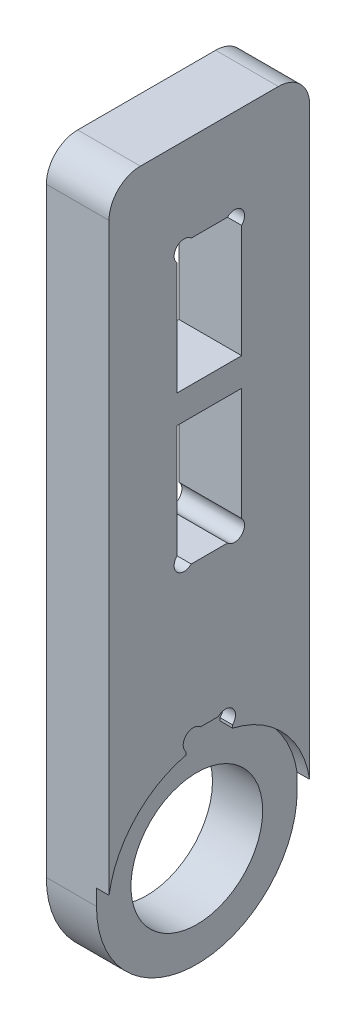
ISO-10303-21;
HEADER;
FILE_DESCRIPTION(('STEP AP214'),'2;1');
FILE_NAME('part.step','',(''),(''),'','','');
FILE_SCHEMA(('AUTOMOTIVE_DESIGN { 1 0 10303 214 1 1 1 1 }'));
ENDSEC;
DATA;
#1=APPLICATION_CONTEXT('core data for automotive mechanical design processes');
#2=APPLICATION_PROTOCOL_DEFINITION('international standard','automotive_design',2000,#1);
#3=PRODUCT_CONTEXT('',#1,'mechanical');
#4=PRODUCT('Part','Part','',(#3));
#5=PRODUCT_RELATED_PRODUCT_CATEGORY('part','',(#4));
#6=PRODUCT_DEFINITION_FORMATION('','',#4);
#7=PRODUCT_DEFINITION_CONTEXT('part definition',#1,'design');
#8=PRODUCT_DEFINITION('design','',#6,#7);
#9=PRODUCT_DEFINITION_SHAPE('','',#8);
#10=(LENGTH_UNIT() NAMED_UNIT(*) SI_UNIT(.MILLI.,.METRE.));
#11=(NAMED_UNIT(*) PLANE_ANGLE_UNIT() SI_UNIT($,.RADIAN.));
#12=(NAMED_UNIT(*) SI_UNIT($,.STERADIAN.) SOLID_ANGLE_UNIT());
#13=UNCERTAINTY_MEASURE_WITH_UNIT(LENGTH_MEASURE(1.E-05),#10,'distance_accuracy_value','');
#14=(GEOMETRIC_REPRESENTATION_CONTEXT(3) GLOBAL_UNCERTAINTY_ASSIGNED_CONTEXT((#13)) GLOBAL_UNIT_ASSIGNED_CONTEXT((#10,
#11,#12)) REPRESENTATION_CONTEXT('',''));
#15=CARTESIAN_POINT('',(0.,0.,0.));
#16=DIRECTION('',(0.,0.,1.));
#17=DIRECTION('',(1.,0.,0.));
#18=AXIS2_PLACEMENT_3D('',#15,#16,#17);
#19=CARTESIAN_POINT('',(10.,0.,0.));
#20=DIRECTION('',(-1.,0.,0.));
#21=DIRECTION('',(0.,0.,1.));
#22=AXIS2_PLACEMENT_3D('',#19,#20,#21);
#23=CYLINDRICAL_SURFACE('',#22,16.);
#24=CARTESIAN_POINT('',(8.,0.,0.));
#25=DIRECTION('',(1.,0.,0.));
#26=DIRECTION('',(0.,0.,-1.));
#27=AXIS2_PLACEMENT_3D('',#24,#25,#26);
#28=CIRCLE('',#27,16.);
#29=CARTESIAN_POINT('',(8.,0.,16.));
#30=VERTEX_POINT('',#29);
#31=CARTESIAN_POINT('',(8.,0.,-16.));
#32=VERTEX_POINT('',#31);
#33=EDGE_CURVE('E271',#30,#32,#28,.T.);
#34=ORIENTED_EDGE('',*,*,#33,.F.);
#35=DIRECTION('',(-1.,0.,0.));
#36=VECTOR('',#35,1.);
#37=CARTESIAN_POINT('',(10.,0.,16.));
#38=LINE('',#37,#36);
#39=CARTESIAN_POINT('',(0.,0.,16.));
#40=VERTEX_POINT('',#39);
#41=EDGE_CURVE('E379',#30,#40,#38,.T.);
#42=ORIENTED_EDGE('',*,*,#41,.T.);
#43=CARTESIAN_POINT('',(0.,0.,0.));
#44=DIRECTION('',(1.,0.,0.));
#45=DIRECTION('',(0.,0.,-1.));
#46=AXIS2_PLACEMENT_3D('',#43,#44,#45);
#47=CIRCLE('',#46,16.);
#48=CARTESIAN_POINT('',(0.,0.,-16.));
#49=VERTEX_POINT('',#48);
#50=EDGE_CURVE('E371',#40,#49,#47,.T.);
#51=ORIENTED_EDGE('',*,*,#50,.T.);
#52=DIRECTION('',(-1.,0.,0.));
#53=VECTOR('',#52,1.);
#54=CARTESIAN_POINT('',(10.,0.,-16.));
#55=LINE('',#54,#53);
#56=EDGE_CURVE('E390',#32,#49,#55,.T.);
#57=ORIENTED_EDGE('',*,*,#56,.F.);
#58=EDGE_LOOP('',(#34,#42,#51,#57));
#59=FACE_BOUND('',#58,.T.);
#60=ADVANCED_FACE('F32',(#59),#23,.T.);
#61=CARTESIAN_POINT('',(10.,0.,0.));
#62=DIRECTION('',(-1.,0.,0.));
#63=DIRECTION('',(0.,0.,1.));
#64=AXIS2_PLACEMENT_3D('',#61,#62,#63);
#65=CYLINDRICAL_SURFACE('',#64,10.5);
#66=CARTESIAN_POINT('',(0.,0.,0.));
#67=DIRECTION('',(1.,0.,0.));
#68=DIRECTION('',(0.,0.,-1.));
#69=AXIS2_PLACEMENT_3D('',#66,#67,#68);
#70=CIRCLE('',#69,10.5);
#71=CARTESIAN_POINT('',(0.,0.,-10.5));
#72=VERTEX_POINT('',#71);
#73=EDGE_CURVE('E368',#72,#72,#70,.T.);
#74=ORIENTED_EDGE('',*,*,#73,.F.);
#75=EDGE_LOOP('',(#74));
#76=FACE_BOUND('',#75,.T.);
#77=CARTESIAN_POINT('',(8.,0.,0.));
#78=DIRECTION('',(1.,0.,0.));
#79=DIRECTION('',(0.,0.,-1.));
#80=AXIS2_PLACEMENT_3D('',#77,#78,#79);
#81=CIRCLE('',#80,10.5);
#82=CARTESIAN_POINT('',(8.,0.,-10.5));
#83=VERTEX_POINT('',#82);
#84=EDGE_CURVE('E260',#83,#83,#81,.T.);
#85=ORIENTED_EDGE('',*,*,#84,.T.);
#86=EDGE_LOOP('',(#85));
#87=FACE_BOUND('',#86,.T.);
#88=ADVANCED_FACE('F441',(#76,#87),#65,.F.);
#89=CARTESIAN_POINT('',(10.,0.,0.));
#90=DIRECTION('',(1.,0.,0.));
#91=DIRECTION('',(0.,0.,-1.));
#92=AXIS2_PLACEMENT_3D('',#89,#90,#91);
#93=PLANE('',#92);
#94=DIRECTION('',(0.,1.,0.));
#95=VECTOR('',#94,1.);
#96=CARTESIAN_POINT('',(10.,0.,-16.));
#97=LINE('',#96,#95);
#98=CARTESIAN_POINT('',(10.,2.5377155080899,-16.));
#99=VERTEX_POINT('',#98);
#100=CARTESIAN_POINT('',(10.,95.735,-16.));
#101=VERTEX_POINT('',#100);
#102=EDGE_CURVE('E372',#99,#101,#97,.T.);
#103=ORIENTED_EDGE('',*,*,#102,.T.);
#104=CARTESIAN_POINT('',(10.,95.735,-11.));
#105=DIRECTION('',(1.,0.,0.));
#106=DIRECTION('',(0.,0.,-1.));
#107=AXIS2_PLACEMENT_3D('',#104,#105,#106);
#108=CIRCLE('',#107,5.);
#109=CARTESIAN_POINT('',(10.,100.735,-11.));
#110=VERTEX_POINT('',#109);
#111=EDGE_CURVE('E40',#101,#110,#108,.T.);
#112=ORIENTED_EDGE('',*,*,#111,.T.);
#113=DIRECTION('',(0.,0.,1.));
#114=VECTOR('',#113,1.);
#115=CARTESIAN_POINT('',(10.,100.735,-16.));
#116=LINE('',#115,#114);
#117=CARTESIAN_POINT('',(10.,100.735,11.));
#118=VERTEX_POINT('',#117);
#119=EDGE_CURVE('E374',#110,#118,#116,.T.);
#120=ORIENTED_EDGE('',*,*,#119,.T.);
#121=CARTESIAN_POINT('',(10.,95.735,11.));
#122=DIRECTION('',(1.,0.,0.));
#123=DIRECTION('',(0.,0.,-1.));
#124=AXIS2_PLACEMENT_3D('',#121,#122,#123);
#125=CIRCLE('',#124,5.);
#126=CARTESIAN_POINT('',(10.,95.735,16.));
#127=VERTEX_POINT('',#126);
#128=EDGE_CURVE('E47',#118,#127,#125,.T.);
#129=ORIENTED_EDGE('',*,*,#128,.T.);
#130=DIRECTION('',(0.,-1.,0.));
#131=VECTOR('',#130,1.);
#132=CARTESIAN_POINT('',(10.,100.735,16.));
#133=LINE('',#132,#131);
#134=CARTESIAN_POINT('',(10.,2.5377155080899,16.));
#135=VERTEX_POINT('',#134);
#136=EDGE_CURVE('E377',#127,#135,#133,.T.);
#137=ORIENTED_EDGE('',*,*,#136,.T.);
#138=CARTESIAN_POINT('',(10.,0.,0.));
#139=DIRECTION('',(1.,0.,0.));
#140=DIRECTION('',(0.,0.,-1.));
#141=AXIS2_PLACEMENT_3D('',#138,#139,#140);
#142=CIRCLE('',#141,16.2);
#143=CARTESIAN_POINT('',(10.,15.7718102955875,3.7));
#144=VERTEX_POINT('',#143);
#145=EDGE_CURVE('E235',#144,#135,#142,.T.);
#146=ORIENTED_EDGE('',*,*,#145,.F.);
#147=DIRECTION('',(0.,-1.,0.));
#148=VECTOR('',#147,1.);
#149=CARTESIAN_POINT('',(10.,16.237258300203,3.7));
#150=LINE('',#149,#148);
#151=CARTESIAN_POINT('',(10.,16.237258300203,3.7));
#152=VERTEX_POINT('',#151);
#153=EDGE_CURVE('E252',#152,#144,#150,.T.);
#154=ORIENTED_EDGE('',*,*,#153,.F.);
#155=CARTESIAN_POINT('',(10.,17.3686291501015,2.56862915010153));
#156=DIRECTION('',(1.,0.,0.));
#157=DIRECTION('',(0.,0.,1.));
#158=AXIS2_PLACEMENT_3D('',#155,#156,#157);
#159=CIRCLE('',#158,1.6);
#160=CARTESIAN_POINT('',(10.,18.5,1.43725830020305));
#161=VERTEX_POINT('',#160);
#162=EDGE_CURVE('E249',#161,#152,#159,.T.);
#163=ORIENTED_EDGE('',*,*,#162,.F.);
#164=DIRECTION('',(0.,0.,1.));
#165=VECTOR('',#164,1.);
#166=CARTESIAN_POINT('',(10.,18.5,1.43725830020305));
#167=LINE('',#166,#165);
#168=CARTESIAN_POINT('',(10.,18.5,-1.43725830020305));
#169=VERTEX_POINT('',#168);
#170=EDGE_CURVE('E247',#169,#161,#167,.T.);
#171=ORIENTED_EDGE('',*,*,#170,.F.);
#172=CARTESIAN_POINT('',(10.,17.3686291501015,-2.56862915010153));
#173=DIRECTION('',(1.,0.,0.));
#174=DIRECTION('',(0.,0.,-1.));
#175=AXIS2_PLACEMENT_3D('',#172,#173,#174);
#176=CIRCLE('',#175,1.6);
#177=CARTESIAN_POINT('',(10.,16.237258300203,-3.7));
#178=VERTEX_POINT('',#177);
#179=EDGE_CURVE('E215',#178,#169,#176,.T.);
#180=ORIENTED_EDGE('',*,*,#179,.F.);
#181=DIRECTION('',(0.,1.,0.));
#182=VECTOR('',#181,1.);
#183=CARTESIAN_POINT('',(10.,16.237258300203,-3.7));
#184=LINE('',#183,#182);
#185=CARTESIAN_POINT('',(10.,15.7718102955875,-3.7));
#186=VERTEX_POINT('',#185);
#187=EDGE_CURVE('E232',#186,#178,#184,.T.);
#188=ORIENTED_EDGE('',*,*,#187,.F.);
#189=EDGE_CURVE('E255',#99,#186,#142,.T.);
#190=ORIENTED_EDGE('',*,*,#189,.F.);
#191=EDGE_LOOP('',(#103,#112,#120,#129,#137,#146,#154,#163,#171,#180,#188,#190));
#192=FACE_BOUND('',#191,.T.);
#193=DIRECTION('',(0.,1.,0.));
#194=VECTOR('',#193,1.);
#195=CARTESIAN_POINT('',(10.,43.997741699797,-5.14999999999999));
#196=LINE('',#195,#194);
#197=CARTESIAN_POINT('',(10.,43.997741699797,-5.14999999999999));
#198=VERTEX_POINT('',#197);
#199=CARTESIAN_POINT('',(10.,61.985,-5.15));
#200=VERTEX_POINT('',#199);
#201=EDGE_CURVE('E326',#198,#200,#196,.T.);
#202=ORIENTED_EDGE('',*,*,#201,.F.);
#203=CARTESIAN_POINT('',(10.,42.8663708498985,-4.01862915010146));
#204=DIRECTION('',(1.,0.,0.));
#205=DIRECTION('',(0.,0.,-1.));
#206=AXIS2_PLACEMENT_3D('',#203,#204,#205);
#207=CIRCLE('',#206,1.60000000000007);
#208=CARTESIAN_POINT('',(10.,41.735,-2.88725830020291));
#209=VERTEX_POINT('',#208);
#210=EDGE_CURVE('E324',#209,#198,#207,.T.);
#211=ORIENTED_EDGE('',*,*,#210,.F.);
#212=DIRECTION('',(0.,0.,-1.));
#213=VECTOR('',#212,1.);
#214=CARTESIAN_POINT('',(10.,41.735,2.88725830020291));
#215=LINE('',#214,#213);
#216=CARTESIAN_POINT('',(10.,41.735,2.88725830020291));
#217=VERTEX_POINT('',#216);
#218=EDGE_CURVE('E336',#217,#209,#215,.T.);
#219=ORIENTED_EDGE('',*,*,#218,.F.);
#220=CARTESIAN_POINT('',(10.,42.8663708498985,4.01862915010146));
#221=DIRECTION('',(1.,0.,0.));
#222=DIRECTION('',(0.,0.,1.));
#223=AXIS2_PLACEMENT_3D('',#220,#221,#222);
#224=CIRCLE('',#223,1.60000000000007);
#225=CARTESIAN_POINT('',(10.,43.997741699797,5.14999999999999));
#226=VERTEX_POINT('',#225);
#227=EDGE_CURVE('E333',#226,#217,#224,.T.);
#228=ORIENTED_EDGE('',*,*,#227,.F.);
#229=DIRECTION('',(0.,-1.,0.));
#230=VECTOR('',#229,1.);
#231=CARTESIAN_POINT('',(10.,43.997741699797,5.14999999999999));
#232=LINE('',#231,#230);
#233=CARTESIAN_POINT('',(10.,61.985,5.15));
#234=VERTEX_POINT('',#233);
#235=EDGE_CURVE('E331',#234,#226,#232,.T.);
#236=ORIENTED_EDGE('',*,*,#235,.F.);
#237=DIRECTION('',(0.,0.,1.));
#238=VECTOR('',#237,1.);
#239=CARTESIAN_POINT('',(10.,61.985,5.15));
#240=LINE('',#239,#238);
#241=EDGE_CURVE('E329',#200,#234,#240,.T.);
#242=ORIENTED_EDGE('',*,*,#241,.F.);
#243=EDGE_LOOP('',(#202,#211,#219,#228,#236,#242));
#244=FACE_BOUND('',#243,.T.);
#245=CARTESIAN_POINT('',(10.,85.6036291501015,-4.01862915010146));
#246=DIRECTION('',(1.,0.,0.));
#247=DIRECTION('',(0.,0.,1.));
#248=AXIS2_PLACEMENT_3D('',#245,#246,#247);
#249=CIRCLE('',#248,1.60000000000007);
#250=CARTESIAN_POINT('',(10.,84.472258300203,-5.14999999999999));
#251=VERTEX_POINT('',#250);
#252=CARTESIAN_POINT('',(10.,86.735,-2.8872583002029));
#253=VERTEX_POINT('',#252);
#254=EDGE_CURVE('E281',#251,#253,#249,.T.);
#255=ORIENTED_EDGE('',*,*,#254,.F.);
#256=DIRECTION('',(0.,1.,0.));
#257=VECTOR('',#256,1.);
#258=CARTESIAN_POINT('',(10.,84.472258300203,-5.14999999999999));
#259=LINE('',#258,#257);
#260=CARTESIAN_POINT('',(10.,66.485,-5.15));
#261=VERTEX_POINT('',#260);
#262=EDGE_CURVE('E279',#261,#251,#259,.T.);
#263=ORIENTED_EDGE('',*,*,#262,.F.);
#264=DIRECTION('',(0.,0.,-1.));
#265=VECTOR('',#264,1.);
#266=CARTESIAN_POINT('',(10.,66.485,5.15));
#267=LINE('',#266,#265);
#268=CARTESIAN_POINT('',(10.,66.485,5.15));
#269=VERTEX_POINT('',#268);
#270=EDGE_CURVE('E291',#269,#261,#267,.T.);
#271=ORIENTED_EDGE('',*,*,#270,.F.);
#272=DIRECTION('',(0.,-1.,0.));
#273=VECTOR('',#272,1.);
#274=CARTESIAN_POINT('',(10.,84.472258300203,5.14999999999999));
#275=LINE('',#274,#273);
#276=CARTESIAN_POINT('',(10.,84.472258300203,5.14999999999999));
#277=VERTEX_POINT('',#276);
#278=EDGE_CURVE('E288',#277,#269,#275,.T.);
#279=ORIENTED_EDGE('',*,*,#278,.F.);
#280=CARTESIAN_POINT('',(10.,85.6036291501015,4.01862915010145));
#281=DIRECTION('',(1.,0.,0.));
#282=DIRECTION('',(0.,0.,-1.));
#283=AXIS2_PLACEMENT_3D('',#280,#281,#282);
#284=CIRCLE('',#283,1.60000000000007);
#285=CARTESIAN_POINT('',(10.,86.735,2.88725830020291));
#286=VERTEX_POINT('',#285);
#287=EDGE_CURVE('E286',#286,#277,#284,.T.);
#288=ORIENTED_EDGE('',*,*,#287,.F.);
#289=DIRECTION('',(0.,0.,1.));
#290=VECTOR('',#289,1.);
#291=CARTESIAN_POINT('',(10.,86.735,2.88725830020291));
#292=LINE('',#291,#290);
#293=EDGE_CURVE('E284',#253,#286,#292,.T.);
#294=ORIENTED_EDGE('',*,*,#293,.F.);
#295=EDGE_LOOP('',(#255,#263,#271,#279,#288,#294));
#296=FACE_BOUND('',#295,.T.);
#297=ADVANCED_FACE('F409',(#192,#244,#296),#93,.T.);
#298=CARTESIAN_POINT('',(0.,0.,0.));
#299=DIRECTION('',(1.,0.,0.));
#300=DIRECTION('',(0.,0.,-1.));
#301=AXIS2_PLACEMENT_3D('',#298,#299,#300);
#302=PLANE('',#301);
#303=CARTESIAN_POINT('',(0.,42.8663708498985,-4.01862915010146));
#304=DIRECTION('',(1.,0.,0.));
#305=DIRECTION('',(0.,0.,-1.));
#306=AXIS2_PLACEMENT_3D('',#303,#304,#305);
#307=CIRCLE('',#306,1.60000000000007);
#308=CARTESIAN_POINT('',(0.,41.735,-2.88725830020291));
#309=VERTEX_POINT('',#308);
#310=CARTESIAN_POINT('',(0.,43.997741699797,-5.14999999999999));
#311=VERTEX_POINT('',#310);
#312=EDGE_CURVE('E323',#309,#311,#307,.T.);
#313=ORIENTED_EDGE('',*,*,#312,.T.);
#314=DIRECTION('',(0.,1.,0.));
#315=VECTOR('',#314,1.);
#316=CARTESIAN_POINT('',(0.,43.997741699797,-5.14999999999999));
#317=LINE('',#316,#315);
#318=CARTESIAN_POINT('',(0.,61.985,-5.15));
#319=VERTEX_POINT('',#318);
#320=EDGE_CURVE('E341',#311,#319,#317,.T.);
#321=ORIENTED_EDGE('',*,*,#320,.T.);
#322=DIRECTION('',(0.,0.,1.));
#323=VECTOR('',#322,1.);
#324=CARTESIAN_POINT('',(0.,61.985,5.15));
#325=LINE('',#324,#323);
#326=CARTESIAN_POINT('',(0.,61.985,5.15));
#327=VERTEX_POINT('',#326);
#328=EDGE_CURVE('E344',#319,#327,#325,.T.);
#329=ORIENTED_EDGE('',*,*,#328,.T.);
#330=DIRECTION('',(0.,-1.,0.));
#331=VECTOR('',#330,1.);
#332=CARTESIAN_POINT('',(0.,43.997741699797,5.14999999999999));
#333=LINE('',#332,#331);
#334=CARTESIAN_POINT('',(0.,43.997741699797,5.14999999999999));
#335=VERTEX_POINT('',#334);
#336=EDGE_CURVE('E347',#327,#335,#333,.T.);
#337=ORIENTED_EDGE('',*,*,#336,.T.);
#338=CARTESIAN_POINT('',(0.,42.8663708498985,4.01862915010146));
#339=DIRECTION('',(1.,0.,0.));
#340=DIRECTION('',(0.,0.,1.));
#341=AXIS2_PLACEMENT_3D('',#338,#339,#340);
#342=CIRCLE('',#341,1.60000000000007);
#343=CARTESIAN_POINT('',(0.,41.735,2.88725830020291));
#344=VERTEX_POINT('',#343);
#345=EDGE_CURVE('E350',#335,#344,#342,.T.);
#346=ORIENTED_EDGE('',*,*,#345,.T.);
#347=DIRECTION('',(0.,0.,-1.));
#348=VECTOR('',#347,1.);
#349=CARTESIAN_POINT('',(0.,41.735,2.88725830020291));
#350=LINE('',#349,#348);
#351=EDGE_CURVE('E327',#344,#309,#350,.T.);
#352=ORIENTED_EDGE('',*,*,#351,.T.);
#353=EDGE_LOOP('',(#313,#321,#329,#337,#346,#352));
#354=FACE_BOUND('',#353,.T.);
#355=DIRECTION('',(0.,0.,1.));
#356=VECTOR('',#355,1.);
#357=CARTESIAN_POINT('',(0.,100.735,-16.));
#358=LINE('',#357,#356);
#359=CARTESIAN_POINT('',(0.,100.735,-11.));
#360=VERTEX_POINT('',#359);
#361=CARTESIAN_POINT('',(0.,100.735,11.));
#362=VERTEX_POINT('',#361);
#363=EDGE_CURVE('E384',#360,#362,#358,.T.);
#364=ORIENTED_EDGE('',*,*,#363,.F.);
#365=CARTESIAN_POINT('',(0.,95.735,-11.));
#366=DIRECTION('',(1.,0.,0.));
#367=DIRECTION('',(0.,0.,-1.));
#368=AXIS2_PLACEMENT_3D('',#365,#366,#367);
#369=CIRCLE('',#368,5.);
#370=CARTESIAN_POINT('',(0.,95.735,-16.));
#371=VERTEX_POINT('',#370);
#372=EDGE_CURVE('E404',#360,#371,#369,.F.);
#373=ORIENTED_EDGE('',*,*,#372,.T.);
#374=DIRECTION('',(0.,1.,0.));
#375=VECTOR('',#374,1.);
#376=CARTESIAN_POINT('',(0.,0.,-16.));
#377=LINE('',#376,#375);
#378=EDGE_CURVE('E382',#49,#371,#377,.T.);
#379=ORIENTED_EDGE('',*,*,#378,.F.);
#380=ORIENTED_EDGE('',*,*,#50,.F.);
#381=DIRECTION('',(0.,-1.,0.));
#382=VECTOR('',#381,1.);
#383=CARTESIAN_POINT('',(0.,100.735,16.));
#384=LINE('',#383,#382);
#385=CARTESIAN_POINT('',(0.,95.735,16.));
#386=VERTEX_POINT('',#385);
#387=EDGE_CURVE('E375',#386,#40,#384,.T.);
#388=ORIENTED_EDGE('',*,*,#387,.F.);
#389=CARTESIAN_POINT('',(0.,95.735,11.));
#390=DIRECTION('',(1.,0.,0.));
#391=DIRECTION('',(0.,0.,-1.));
#392=AXIS2_PLACEMENT_3D('',#389,#390,#391);
#393=CIRCLE('',#392,5.);
#394=EDGE_CURVE('E402',#386,#362,#393,.F.);
#395=ORIENTED_EDGE('',*,*,#394,.T.);
#396=EDGE_LOOP('',(#364,#373,#379,#380,#388,#395));
#397=FACE_BOUND('',#396,.T.);
#398=ORIENTED_EDGE('',*,*,#73,.T.);
#399=EDGE_LOOP('',(#398));
#400=FACE_BOUND('',#399,.T.);
#401=DIRECTION('',(0.,1.,0.));
#402=VECTOR('',#401,1.);
#403=CARTESIAN_POINT('',(0.,84.472258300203,-5.14999999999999));
#404=LINE('',#403,#402);
#405=CARTESIAN_POINT('',(0.,66.485,-5.15));
#406=VERTEX_POINT('',#405);
#407=CARTESIAN_POINT('',(0.,84.472258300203,-5.14999999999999));
#408=VERTEX_POINT('',#407);
#409=EDGE_CURVE('E278',#406,#408,#404,.T.);
#410=ORIENTED_EDGE('',*,*,#409,.T.);
#411=CARTESIAN_POINT('',(0.,85.6036291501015,-4.01862915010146));
#412=DIRECTION('',(1.,0.,0.));
#413=DIRECTION('',(0.,0.,1.));
#414=AXIS2_PLACEMENT_3D('',#411,#412,#413);
#415=CIRCLE('',#414,1.60000000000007);
#416=CARTESIAN_POINT('',(0.,86.735,-2.8872583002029));
#417=VERTEX_POINT('',#416);
#418=EDGE_CURVE('E296',#408,#417,#415,.T.);
#419=ORIENTED_EDGE('',*,*,#418,.T.);
#420=DIRECTION('',(0.,0.,1.));
#421=VECTOR('',#420,1.);
#422=CARTESIAN_POINT('',(0.,86.735,2.88725830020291));
#423=LINE('',#422,#421);
#424=CARTESIAN_POINT('',(0.,86.735,2.88725830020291));
#425=VERTEX_POINT('',#424);
#426=EDGE_CURVE('E299',#417,#425,#423,.T.);
#427=ORIENTED_EDGE('',*,*,#426,.T.);
#428=CARTESIAN_POINT('',(0.,85.6036291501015,4.01862915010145));
#429=DIRECTION('',(1.,0.,0.));
#430=DIRECTION('',(0.,0.,-1.));
#431=AXIS2_PLACEMENT_3D('',#428,#429,#430);
#432=CIRCLE('',#431,1.60000000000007);
#433=CARTESIAN_POINT('',(0.,84.472258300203,5.14999999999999));
#434=VERTEX_POINT('',#433);
#435=EDGE_CURVE('E302',#425,#434,#432,.T.);
#436=ORIENTED_EDGE('',*,*,#435,.T.);
#437=DIRECTION('',(0.,-1.,0.));
#438=VECTOR('',#437,1.);
#439=CARTESIAN_POINT('',(0.,84.472258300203,5.14999999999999));
#440=LINE('',#439,#438);
#441=CARTESIAN_POINT('',(0.,66.485,5.15));
#442=VERTEX_POINT('',#441);
#443=EDGE_CURVE('E305',#434,#442,#440,.T.);
#444=ORIENTED_EDGE('',*,*,#443,.T.);
#445=DIRECTION('',(0.,0.,-1.));
#446=VECTOR('',#445,1.);
#447=CARTESIAN_POINT('',(0.,66.485,5.15));
#448=LINE('',#447,#446);
#449=EDGE_CURVE('E282',#442,#406,#448,.T.);
#450=ORIENTED_EDGE('',*,*,#449,.T.);
#451=EDGE_LOOP('',(#410,#419,#427,#436,#444,#450));
#452=FACE_BOUND('',#451,.T.);
#453=ADVANCED_FACE('F421',(#354,#397,#400,#452),#302,.F.);
#454=CARTESIAN_POINT('',(10.,0.,-16.));
#455=DIRECTION('',(0.,0.,1.));
#456=DIRECTION('',(1.,0.,0.));
#457=AXIS2_PLACEMENT_3D('',#454,#455,#456);
#458=PLANE('',#457);
#459=ORIENTED_EDGE('',*,*,#378,.T.);
#460=DIRECTION('',(-1.,0.,0.));
#461=VECTOR('',#460,1.);
#462=CARTESIAN_POINT('',(10.,95.735,-16.));
#463=LINE('',#462,#461);
#464=EDGE_CURVE('E55',#371,#101,#463,.F.);
#465=ORIENTED_EDGE('',*,*,#464,.T.);
#466=ORIENTED_EDGE('',*,*,#102,.F.);
#467=DIRECTION('',(1.,0.,0.));
#468=VECTOR('',#467,1.);
#469=CARTESIAN_POINT('',(8.,2.5377155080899,-16.));
#470=LINE('',#469,#468);
#471=CARTESIAN_POINT('',(8.,2.5377155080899,-16.));
#472=VERTEX_POINT('',#471);
#473=EDGE_CURVE('E275',#99,#472,#470,.F.);
#474=ORIENTED_EDGE('',*,*,#473,.T.);
#475=DIRECTION('',(0.,1.,0.));
#476=VECTOR('',#475,1.);
#477=CARTESIAN_POINT('',(8.,0.,-16.));
#478=LINE('',#477,#476);
#479=EDGE_CURVE('E273',#32,#472,#478,.T.);
#480=ORIENTED_EDGE('',*,*,#479,.F.);
#481=ORIENTED_EDGE('',*,*,#56,.T.);
#482=EDGE_LOOP('',(#459,#465,#466,#474,#480,#481));
#483=FACE_BOUND('',#482,.T.);
#484=ADVANCED_FACE('F424',(#483),#458,.F.);
#485=CARTESIAN_POINT('',(10.,100.735,-16.));
#486=DIRECTION('',(0.,-1.,0.));
#487=DIRECTION('',(0.,0.,-1.));
#488=AXIS2_PLACEMENT_3D('',#485,#486,#487);
#489=PLANE('',#488);
#490=ORIENTED_EDGE('',*,*,#119,.F.);
#491=DIRECTION('',(-1.,0.,0.));
#492=VECTOR('',#491,1.);
#493=CARTESIAN_POINT('',(10.,100.735,-11.));
#494=LINE('',#493,#492);
#495=EDGE_CURVE('E399',#110,#360,#494,.T.);
#496=ORIENTED_EDGE('',*,*,#495,.T.);
#497=ORIENTED_EDGE('',*,*,#363,.T.);
#498=DIRECTION('',(-1.,0.,0.));
#499=VECTOR('',#498,1.);
#500=CARTESIAN_POINT('',(10.,100.735,11.));
#501=LINE('',#500,#499);
#502=EDGE_CURVE('E397',#362,#118,#501,.F.);
#503=ORIENTED_EDGE('',*,*,#502,.T.);
#504=EDGE_LOOP('',(#490,#496,#497,#503));
#505=FACE_BOUND('',#504,.T.);
#506=ADVANCED_FACE('F415',(#505),#489,.F.);
#507=CARTESIAN_POINT('',(10.,100.735,16.));
#508=DIRECTION('',(0.,0.,-1.));
#509=DIRECTION('',(-1.,0.,0.));
#510=AXIS2_PLACEMENT_3D('',#507,#508,#509);
#511=PLANE('',#510);
#512=ORIENTED_EDGE('',*,*,#136,.F.);
#513=DIRECTION('',(-1.,0.,0.));
#514=VECTOR('',#513,1.);
#515=CARTESIAN_POINT('',(10.,95.735,16.));
#516=LINE('',#515,#514);
#517=EDGE_CURVE('E11',#127,#386,#516,.T.);
#518=ORIENTED_EDGE('',*,*,#517,.T.);
#519=ORIENTED_EDGE('',*,*,#387,.T.);
#520=ORIENTED_EDGE('',*,*,#41,.F.);
#521=DIRECTION('',(0.,-1.,0.));
#522=VECTOR('',#521,1.);
#523=CARTESIAN_POINT('',(8.,100.735,16.));
#524=LINE('',#523,#522);
#525=CARTESIAN_POINT('',(8.,2.5377155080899,16.));
#526=VERTEX_POINT('',#525);
#527=EDGE_CURVE('E269',#526,#30,#524,.T.);
#528=ORIENTED_EDGE('',*,*,#527,.F.);
#529=DIRECTION('',(1.,0.,0.));
#530=VECTOR('',#529,1.);
#531=CARTESIAN_POINT('',(8.,2.5377155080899,16.));
#532=LINE('',#531,#530);
#533=EDGE_CURVE('E392',#526,#135,#532,.T.);
#534=ORIENTED_EDGE('',*,*,#533,.T.);
#535=EDGE_LOOP('',(#512,#518,#519,#520,#528,#534));
#536=FACE_BOUND('',#535,.T.);
#537=ADVANCED_FACE('F432',(#536),#511,.F.);
#538=CARTESIAN_POINT('',(10.,42.8663708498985,-4.01862915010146));
#539=DIRECTION('',(-1.,0.,0.));
#540=DIRECTION('',(0.,0.,1.));
#541=AXIS2_PLACEMENT_3D('',#538,#539,#540);
#542=CYLINDRICAL_SURFACE('',#541,1.60000000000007);
#543=ORIENTED_EDGE('',*,*,#312,.F.);
#544=DIRECTION('',(-1.,0.,0.));
#545=VECTOR('',#544,1.);
#546=CARTESIAN_POINT('',(10.,41.735,-2.88725830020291));
#547=LINE('',#546,#545);
#548=EDGE_CURVE('E338',#209,#309,#547,.T.);
#549=ORIENTED_EDGE('',*,*,#548,.F.);
#550=ORIENTED_EDGE('',*,*,#210,.T.);
#551=DIRECTION('',(-1.,0.,0.));
#552=VECTOR('',#551,1.);
#553=CARTESIAN_POINT('',(10.,43.997741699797,-5.14999999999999));
#554=LINE('',#553,#552);
#555=EDGE_CURVE('E365',#198,#311,#554,.T.);
#556=ORIENTED_EDGE('',*,*,#555,.T.);
#557=EDGE_LOOP('',(#543,#549,#550,#556));
#558=FACE_BOUND('',#557,.T.);
#559=ADVANCED_FACE('F455',(#558),#542,.F.);
#560=CARTESIAN_POINT('',(10.,43.997741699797,-5.14999999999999));
#561=DIRECTION('',(0.,0.,1.));
#562=DIRECTION('',(0.,-1.,0.));
#563=AXIS2_PLACEMENT_3D('',#560,#561,#562);
#564=PLANE('',#563);
#565=ORIENTED_EDGE('',*,*,#320,.F.);
#566=ORIENTED_EDGE('',*,*,#555,.F.);
#567=ORIENTED_EDGE('',*,*,#201,.T.);
#568=DIRECTION('',(-1.,0.,0.));
#569=VECTOR('',#568,1.);
#570=CARTESIAN_POINT('',(10.,61.985,-5.15));
#571=LINE('',#570,#569);
#572=EDGE_CURVE('E363',#200,#319,#571,.T.);
#573=ORIENTED_EDGE('',*,*,#572,.T.);
#574=EDGE_LOOP('',(#565,#566,#567,#573));
#575=FACE_BOUND('',#574,.T.);
#576=ADVANCED_FACE('F463',(#575),#564,.T.);
#577=CARTESIAN_POINT('',(10.,61.985,5.15));
#578=DIRECTION('',(0.,-1.,0.));
#579=DIRECTION('',(0.,0.,-1.));
#580=AXIS2_PLACEMENT_3D('',#577,#578,#579);
#581=PLANE('',#580);
#582=ORIENTED_EDGE('',*,*,#328,.F.);
#583=ORIENTED_EDGE('',*,*,#572,.F.);
#584=ORIENTED_EDGE('',*,*,#241,.T.);
#585=DIRECTION('',(-1.,0.,0.));
#586=VECTOR('',#585,1.);
#587=CARTESIAN_POINT('',(10.,61.985,5.15));
#588=LINE('',#587,#586);
#589=EDGE_CURVE('E361',#234,#327,#588,.T.);
#590=ORIENTED_EDGE('',*,*,#589,.T.);
#591=EDGE_LOOP('',(#582,#583,#584,#590));
#592=FACE_BOUND('',#591,.T.);
#593=ADVANCED_FACE('F467',(#592),#581,.T.);
#594=CARTESIAN_POINT('',(10.,43.997741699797,5.14999999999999));
#595=DIRECTION('',(0.,0.,-1.));
#596=DIRECTION('',(0.,1.,0.));
#597=AXIS2_PLACEMENT_3D('',#594,#595,#596);
#598=PLANE('',#597);
#599=ORIENTED_EDGE('',*,*,#336,.F.);
#600=ORIENTED_EDGE('',*,*,#589,.F.);
#601=ORIENTED_EDGE('',*,*,#235,.T.);
#602=DIRECTION('',(-1.,0.,0.));
#603=VECTOR('',#602,1.);
#604=CARTESIAN_POINT('',(10.,43.997741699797,5.14999999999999));
#605=LINE('',#604,#603);
#606=EDGE_CURVE('E359',#226,#335,#605,.T.);
#607=ORIENTED_EDGE('',*,*,#606,.T.);
#608=EDGE_LOOP('',(#599,#600,#601,#607));
#609=FACE_BOUND('',#608,.T.);
#610=ADVANCED_FACE('F471',(#609),#598,.T.);
#611=CARTESIAN_POINT('',(10.,42.8663708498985,4.01862915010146));
#612=DIRECTION('',(-1.,0.,0.));
#613=DIRECTION('',(0.,0.,1.));
#614=AXIS2_PLACEMENT_3D('',#611,#612,#613);
#615=CYLINDRICAL_SURFACE('',#614,1.60000000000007);
#616=ORIENTED_EDGE('',*,*,#345,.F.);
#617=ORIENTED_EDGE('',*,*,#606,.F.);
#618=ORIENTED_EDGE('',*,*,#227,.T.);
#619=DIRECTION('',(-1.,0.,0.));
#620=VECTOR('',#619,1.);
#621=CARTESIAN_POINT('',(10.,41.735,2.88725830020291));
#622=LINE('',#621,#620);
#623=EDGE_CURVE('E357',#217,#344,#622,.T.);
#624=ORIENTED_EDGE('',*,*,#623,.T.);
#625=EDGE_LOOP('',(#616,#617,#618,#624));
#626=FACE_BOUND('',#625,.T.);
#627=ADVANCED_FACE('F475',(#626),#615,.F.);
#628=CARTESIAN_POINT('',(10.,41.735,2.88725830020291));
#629=DIRECTION('',(0.,1.,0.));
#630=DIRECTION('',(0.,0.,1.));
#631=AXIS2_PLACEMENT_3D('',#628,#629,#630);
#632=PLANE('',#631);
#633=ORIENTED_EDGE('',*,*,#351,.F.);
#634=ORIENTED_EDGE('',*,*,#623,.F.);
#635=ORIENTED_EDGE('',*,*,#218,.T.);
#636=ORIENTED_EDGE('',*,*,#548,.T.);
#637=EDGE_LOOP('',(#633,#634,#635,#636));
#638=FACE_BOUND('',#637,.T.);
#639=ADVANCED_FACE('F479',(#638),#632,.T.);
#640=CARTESIAN_POINT('',(10.,84.472258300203,-5.14999999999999));
#641=DIRECTION('',(0.,0.,1.));
#642=DIRECTION('',(0.,-1.,0.));
#643=AXIS2_PLACEMENT_3D('',#640,#641,#642);
#644=PLANE('',#643);
#645=ORIENTED_EDGE('',*,*,#409,.F.);
#646=DIRECTION('',(-1.,0.,0.));
#647=VECTOR('',#646,1.);
#648=CARTESIAN_POINT('',(10.,66.485,-5.15));
#649=LINE('',#648,#647);
#650=EDGE_CURVE('E293',#261,#406,#649,.T.);
#651=ORIENTED_EDGE('',*,*,#650,.F.);
#652=ORIENTED_EDGE('',*,*,#262,.T.);
#653=DIRECTION('',(-1.,0.,0.));
#654=VECTOR('',#653,1.);
#655=CARTESIAN_POINT('',(10.,84.472258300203,-5.14999999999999));
#656=LINE('',#655,#654);
#657=EDGE_CURVE('E320',#251,#408,#656,.T.);
#658=ORIENTED_EDGE('',*,*,#657,.T.);
#659=EDGE_LOOP('',(#645,#651,#652,#658));
#660=FACE_BOUND('',#659,.T.);
#661=ADVANCED_FACE('F483',(#660),#644,.T.);
#662=CARTESIAN_POINT('',(10.,85.6036291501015,-4.01862915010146));
#663=DIRECTION('',(-1.,0.,0.));
#664=DIRECTION('',(0.,0.,1.));
#665=AXIS2_PLACEMENT_3D('',#662,#663,#664);
#666=CYLINDRICAL_SURFACE('',#665,1.60000000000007);
#667=ORIENTED_EDGE('',*,*,#418,.F.);
#668=ORIENTED_EDGE('',*,*,#657,.F.);
#669=ORIENTED_EDGE('',*,*,#254,.T.);
#670=DIRECTION('',(-1.,0.,0.));
#671=VECTOR('',#670,1.);
#672=CARTESIAN_POINT('',(10.,86.735,-2.8872583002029));
#673=LINE('',#672,#671);
#674=EDGE_CURVE('E318',#253,#417,#673,.T.);
#675=ORIENTED_EDGE('',*,*,#674,.T.);
#676=EDGE_LOOP('',(#667,#668,#669,#675));
#677=FACE_BOUND('',#676,.T.);
#678=ADVANCED_FACE('F487',(#677),#666,.F.);
#679=CARTESIAN_POINT('',(10.,86.735,2.88725830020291));
#680=DIRECTION('',(0.,-1.,0.));
#681=DIRECTION('',(0.,0.,-1.));
#682=AXIS2_PLACEMENT_3D('',#679,#680,#681);
#683=PLANE('',#682);
#684=ORIENTED_EDGE('',*,*,#426,.F.);
#685=ORIENTED_EDGE('',*,*,#674,.F.);
#686=ORIENTED_EDGE('',*,*,#293,.T.);
#687=DIRECTION('',(-1.,0.,0.));
#688=VECTOR('',#687,1.);
#689=CARTESIAN_POINT('',(10.,86.735,2.88725830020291));
#690=LINE('',#689,#688);
#691=EDGE_CURVE('E316',#286,#425,#690,.T.);
#692=ORIENTED_EDGE('',*,*,#691,.T.);
#693=EDGE_LOOP('',(#684,#685,#686,#692));
#694=FACE_BOUND('',#693,.T.);
#695=ADVANCED_FACE('F491',(#694),#683,.T.);
#696=CARTESIAN_POINT('',(10.,85.6036291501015,4.01862915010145));
#697=DIRECTION('',(-1.,0.,0.));
#698=DIRECTION('',(0.,0.,1.));
#699=AXIS2_PLACEMENT_3D('',#696,#697,#698);
#700=CYLINDRICAL_SURFACE('',#699,1.60000000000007);
#701=ORIENTED_EDGE('',*,*,#435,.F.);
#702=ORIENTED_EDGE('',*,*,#691,.F.);
#703=ORIENTED_EDGE('',*,*,#287,.T.);
#704=DIRECTION('',(-1.,0.,0.));
#705=VECTOR('',#704,1.);
#706=CARTESIAN_POINT('',(10.,84.472258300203,5.14999999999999));
#707=LINE('',#706,#705);
#708=EDGE_CURVE('E314',#277,#434,#707,.T.);
#709=ORIENTED_EDGE('',*,*,#708,.T.);
#710=EDGE_LOOP('',(#701,#702,#703,#709));
#711=FACE_BOUND('',#710,.T.);
#712=ADVANCED_FACE('F495',(#711),#700,.F.);
#713=CARTESIAN_POINT('',(10.,84.472258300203,5.14999999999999));
#714=DIRECTION('',(0.,0.,-1.));
#715=DIRECTION('',(0.,1.,0.));
#716=AXIS2_PLACEMENT_3D('',#713,#714,#715);
#717=PLANE('',#716);
#718=ORIENTED_EDGE('',*,*,#443,.F.);
#719=ORIENTED_EDGE('',*,*,#708,.F.);
#720=ORIENTED_EDGE('',*,*,#278,.T.);
#721=DIRECTION('',(-1.,0.,0.));
#722=VECTOR('',#721,1.);
#723=CARTESIAN_POINT('',(10.,66.485,5.15));
#724=LINE('',#723,#722);
#725=EDGE_CURVE('E312',#269,#442,#724,.T.);
#726=ORIENTED_EDGE('',*,*,#725,.T.);
#727=EDGE_LOOP('',(#718,#719,#720,#726));
#728=FACE_BOUND('',#727,.T.);
#729=ADVANCED_FACE('F499',(#728),#717,.T.);
#730=CARTESIAN_POINT('',(10.,66.485,5.15));
#731=DIRECTION('',(0.,1.,0.));
#732=DIRECTION('',(0.,0.,1.));
#733=AXIS2_PLACEMENT_3D('',#730,#731,#732);
#734=PLANE('',#733);
#735=ORIENTED_EDGE('',*,*,#449,.F.);
#736=ORIENTED_EDGE('',*,*,#725,.F.);
#737=ORIENTED_EDGE('',*,*,#270,.T.);
#738=ORIENTED_EDGE('',*,*,#650,.T.);
#739=EDGE_LOOP('',(#735,#736,#737,#738));
#740=FACE_BOUND('',#739,.T.);
#741=ADVANCED_FACE('F503',(#740),#734,.T.);
#742=CARTESIAN_POINT('',(8.,0.,0.));
#743=DIRECTION('',(1.,0.,0.));
#744=DIRECTION('',(0.,0.,-1.));
#745=AXIS2_PLACEMENT_3D('',#742,#743,#744);
#746=CYLINDRICAL_SURFACE('',#745,16.2);
#747=ORIENTED_EDGE('',*,*,#189,.T.);
#748=DIRECTION('',(1.,0.,0.));
#749=VECTOR('',#748,1.);
#750=CARTESIAN_POINT('',(8.,15.7718102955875,-3.7));
#751=LINE('',#750,#749);
#752=CARTESIAN_POINT('',(8.,15.7718102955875,-3.7));
#753=VERTEX_POINT('',#752);
#754=EDGE_CURVE('E261',#753,#186,#751,.T.);
#755=ORIENTED_EDGE('',*,*,#754,.F.);
#756=CARTESIAN_POINT('',(8.,0.,0.));
#757=DIRECTION('',(1.,0.,0.));
#758=DIRECTION('',(0.,0.,-1.));
#759=AXIS2_PLACEMENT_3D('',#756,#757,#758);
#760=CIRCLE('',#759,16.2);
#761=EDGE_CURVE('E242',#472,#753,#760,.T.);
#762=ORIENTED_EDGE('',*,*,#761,.F.);
#763=ORIENTED_EDGE('',*,*,#473,.F.);
#764=EDGE_LOOP('',(#747,#755,#762,#763));
#765=FACE_BOUND('',#764,.T.);
#766=ADVANCED_FACE('F507',(#765),#746,.F.);
#767=CARTESIAN_POINT('',(8.,15.7718102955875,3.7));
#768=VERTEX_POINT('',#767);
#769=EDGE_CURVE('E243',#768,#526,#760,.T.);
#770=ORIENTED_EDGE('',*,*,#769,.F.);
#771=DIRECTION('',(1.,0.,0.));
#772=VECTOR('',#771,1.);
#773=CARTESIAN_POINT('',(8.,15.7718102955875,3.7));
#774=LINE('',#773,#772);
#775=EDGE_CURVE('E264',#768,#144,#774,.T.);
#776=ORIENTED_EDGE('',*,*,#775,.T.);
#777=ORIENTED_EDGE('',*,*,#145,.T.);
#778=ORIENTED_EDGE('',*,*,#533,.F.);
#779=EDGE_LOOP('',(#770,#776,#777,#778));
#780=FACE_BOUND('',#779,.T.);
#781=ADVANCED_FACE('F524',(#780),#746,.F.);
#782=CARTESIAN_POINT('',(8.,17.3686291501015,-2.56862915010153));
#783=DIRECTION('',(1.,0.,0.));
#784=DIRECTION('',(0.,0.,-1.));
#785=AXIS2_PLACEMENT_3D('',#782,#783,#784);
#786=PLANE('',#785);
#787=ORIENTED_EDGE('',*,*,#84,.F.);
#788=EDGE_LOOP('',(#787));
#789=FACE_BOUND('',#788,.T.);
#790=ORIENTED_EDGE('',*,*,#479,.T.);
#791=ORIENTED_EDGE('',*,*,#761,.T.);
#792=DIRECTION('',(0.,1.,0.));
#793=VECTOR('',#792,1.);
#794=CARTESIAN_POINT('',(8.,16.237258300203,-3.7));
#795=LINE('',#794,#793);
#796=CARTESIAN_POINT('',(8.,16.237258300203,-3.7));
#797=VERTEX_POINT('',#796);
#798=EDGE_CURVE('E220',#753,#797,#795,.T.);
#799=ORIENTED_EDGE('',*,*,#798,.T.);
#800=CARTESIAN_POINT('',(8.,17.3686291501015,-2.56862915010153));
#801=DIRECTION('',(1.,0.,0.));
#802=DIRECTION('',(0.,0.,-1.));
#803=AXIS2_PLACEMENT_3D('',#800,#801,#802);
#804=CIRCLE('',#803,1.6);
#805=CARTESIAN_POINT('',(8.,18.5,-1.43725830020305));
#806=VERTEX_POINT('',#805);
#807=EDGE_CURVE('E212',#797,#806,#804,.T.);
#808=ORIENTED_EDGE('',*,*,#807,.T.);
#809=DIRECTION('',(0.,0.,1.));
#810=VECTOR('',#809,1.);
#811=CARTESIAN_POINT('',(8.,18.5,1.43725830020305));
#812=LINE('',#811,#810);
#813=CARTESIAN_POINT('',(8.,18.5,1.43725830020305));
#814=VERTEX_POINT('',#813);
#815=EDGE_CURVE('E223',#806,#814,#812,.T.);
#816=ORIENTED_EDGE('',*,*,#815,.T.);
#817=CARTESIAN_POINT('',(8.,17.3686291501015,2.56862915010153));
#818=DIRECTION('',(1.,0.,0.));
#819=DIRECTION('',(0.,0.,1.));
#820=AXIS2_PLACEMENT_3D('',#817,#818,#819);
#821=CIRCLE('',#820,1.6);
#822=CARTESIAN_POINT('',(8.,16.237258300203,3.7));
#823=VERTEX_POINT('',#822);
#824=EDGE_CURVE('E228',#814,#823,#821,.T.);
#825=ORIENTED_EDGE('',*,*,#824,.T.);
#826=DIRECTION('',(0.,-1.,0.));
#827=VECTOR('',#826,1.);
#828=CARTESIAN_POINT('',(8.,16.237258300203,3.7));
#829=LINE('',#828,#827);
#830=EDGE_CURVE('E239',#823,#768,#829,.T.);
#831=ORIENTED_EDGE('',*,*,#830,.T.);
#832=ORIENTED_EDGE('',*,*,#769,.T.);
#833=ORIENTED_EDGE('',*,*,#527,.T.);
#834=ORIENTED_EDGE('',*,*,#33,.T.);
#835=EDGE_LOOP('',(#790,#791,#799,#808,#816,#825,#831,#832,#833,#834));
#836=FACE_BOUND('',#835,.T.);
#837=ADVANCED_FACE('F230',(#789,#836),#786,.T.);
#838=CARTESIAN_POINT('',(8.,17.3686291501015,-2.56862915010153));
#839=DIRECTION('',(1.,0.,0.));
#840=DIRECTION('',(0.,0.,-1.));
#841=AXIS2_PLACEMENT_3D('',#838,#839,#840);
#842=CYLINDRICAL_SURFACE('',#841,1.6);
#843=ORIENTED_EDGE('',*,*,#179,.T.);
#844=DIRECTION('',(1.,0.,0.));
#845=VECTOR('',#844,1.);
#846=CARTESIAN_POINT('',(8.,18.5,-1.43725830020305));
#847=LINE('',#846,#845);
#848=EDGE_CURVE('E208',#806,#169,#847,.T.);
#849=ORIENTED_EDGE('',*,*,#848,.F.);
#850=ORIENTED_EDGE('',*,*,#807,.F.);
#851=DIRECTION('',(1.,0.,0.));
#852=VECTOR('',#851,1.);
#853=CARTESIAN_POINT('',(8.,16.237258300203,-3.7));
#854=LINE('',#853,#852);
#855=EDGE_CURVE('E258',#797,#178,#854,.T.);
#856=ORIENTED_EDGE('',*,*,#855,.T.);
#857=EDGE_LOOP('',(#843,#849,#850,#856));
#858=FACE_BOUND('',#857,.T.);
#859=ADVANCED_FACE('F210',(#858),#842,.F.);
#860=CARTESIAN_POINT('',(8.,16.237258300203,-3.7));
#861=DIRECTION('',(0.,0.,-1.));
#862=DIRECTION('',(0.,1.,0.));
#863=AXIS2_PLACEMENT_3D('',#860,#861,#862);
#864=PLANE('',#863);
#865=ORIENTED_EDGE('',*,*,#187,.T.);
#866=ORIENTED_EDGE('',*,*,#855,.F.);
#867=ORIENTED_EDGE('',*,*,#798,.F.);
#868=ORIENTED_EDGE('',*,*,#754,.T.);
#869=EDGE_LOOP('',(#865,#866,#867,#868));
#870=FACE_BOUND('',#869,.T.);
#871=ADVANCED_FACE('F511',(#870),#864,.F.);
#872=CARTESIAN_POINT('',(8.,16.237258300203,3.7));
#873=DIRECTION('',(0.,0.,1.));
#874=DIRECTION('',(0.,-1.,0.));
#875=AXIS2_PLACEMENT_3D('',#872,#873,#874);
#876=PLANE('',#875);
#877=ORIENTED_EDGE('',*,*,#153,.T.);
#878=ORIENTED_EDGE('',*,*,#775,.F.);
#879=ORIENTED_EDGE('',*,*,#830,.F.);
#880=DIRECTION('',(1.,0.,0.));
#881=VECTOR('',#880,1.);
#882=CARTESIAN_POINT('',(8.,16.237258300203,3.7));
#883=LINE('',#882,#881);
#884=EDGE_CURVE('E266',#823,#152,#883,.T.);
#885=ORIENTED_EDGE('',*,*,#884,.T.);
#886=EDGE_LOOP('',(#877,#878,#879,#885));
#887=FACE_BOUND('',#886,.T.);
#888=ADVANCED_FACE('F517',(#887),#876,.F.);
#889=CARTESIAN_POINT('',(8.,17.3686291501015,2.56862915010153));
#890=DIRECTION('',(1.,0.,0.));
#891=DIRECTION('',(0.,0.,-1.));
#892=AXIS2_PLACEMENT_3D('',#889,#890,#891);
#893=CYLINDRICAL_SURFACE('',#892,1.6);
#894=ORIENTED_EDGE('',*,*,#162,.T.);
#895=ORIENTED_EDGE('',*,*,#884,.F.);
#896=ORIENTED_EDGE('',*,*,#824,.F.);
#897=DIRECTION('',(1.,0.,0.));
#898=VECTOR('',#897,1.);
#899=CARTESIAN_POINT('',(8.,18.5,1.43725830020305));
#900=LINE('',#899,#898);
#901=EDGE_CURVE('E219',#814,#161,#900,.T.);
#902=ORIENTED_EDGE('',*,*,#901,.T.);
#903=EDGE_LOOP('',(#894,#895,#896,#902));
#904=FACE_BOUND('',#903,.T.);
#905=ADVANCED_FACE('F514',(#904),#893,.F.);
#906=CARTESIAN_POINT('',(8.,18.5,1.43725830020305));
#907=DIRECTION('',(0.,1.,0.));
#908=DIRECTION('',(0.,0.,1.));
#909=AXIS2_PLACEMENT_3D('',#906,#907,#908);
#910=PLANE('',#909);
#911=ORIENTED_EDGE('',*,*,#170,.T.);
#912=ORIENTED_EDGE('',*,*,#901,.F.);
#913=ORIENTED_EDGE('',*,*,#815,.F.);
#914=ORIENTED_EDGE('',*,*,#848,.T.);
#915=EDGE_LOOP('',(#911,#912,#913,#914));
#916=FACE_BOUND('',#915,.T.);
#917=ADVANCED_FACE('F224',(#916),#910,.F.);
#918=CARTESIAN_POINT('',(10.,95.735,-11.));
#919=DIRECTION('',(-1.,0.,0.));
#920=DIRECTION('',(0.,0.,1.));
#921=AXIS2_PLACEMENT_3D('',#918,#919,#920);
#922=CYLINDRICAL_SURFACE('',#921,5.);
#923=ORIENTED_EDGE('',*,*,#111,.F.);
#924=ORIENTED_EDGE('',*,*,#464,.F.);
#925=ORIENTED_EDGE('',*,*,#372,.F.);
#926=ORIENTED_EDGE('',*,*,#495,.F.);
#927=EDGE_LOOP('',(#923,#924,#925,#926));
#928=FACE_BOUND('',#927,.T.);
#929=ADVANCED_FACE('F418',(#928),#922,.T.);
#930=CARTESIAN_POINT('',(10.,95.735,11.));
#931=DIRECTION('',(-1.,0.,0.));
#932=DIRECTION('',(0.,0.,1.));
#933=AXIS2_PLACEMENT_3D('',#930,#931,#932);
#934=CYLINDRICAL_SURFACE('',#933,5.);
#935=ORIENTED_EDGE('',*,*,#128,.F.);
#936=ORIENTED_EDGE('',*,*,#502,.F.);
#937=ORIENTED_EDGE('',*,*,#394,.F.);
#938=ORIENTED_EDGE('',*,*,#517,.F.);
#939=EDGE_LOOP('',(#935,#936,#937,#938));
#940=FACE_BOUND('',#939,.T.);
#941=ADVANCED_FACE('F34',(#940),#934,.T.);
#942=CLOSED_SHELL('',(#60,#88,#297,#453,#484,#506,#537,#559,#576,#593,#610,#627,#639,#661,#678,
#695,#712,#729,#741,#766,#781,#837,#859,#871,#888,#905,#917,#929,#941));
#943=MANIFOLD_SOLID_BREP('B2',#942);
#944=ADVANCED_BREP_SHAPE_REPRESENTATION('',(#18,#943),#14);
#945=SHAPE_DEFINITION_REPRESENTATION(#9,#944);
ENDSEC;
END-ISO-10303-21;
